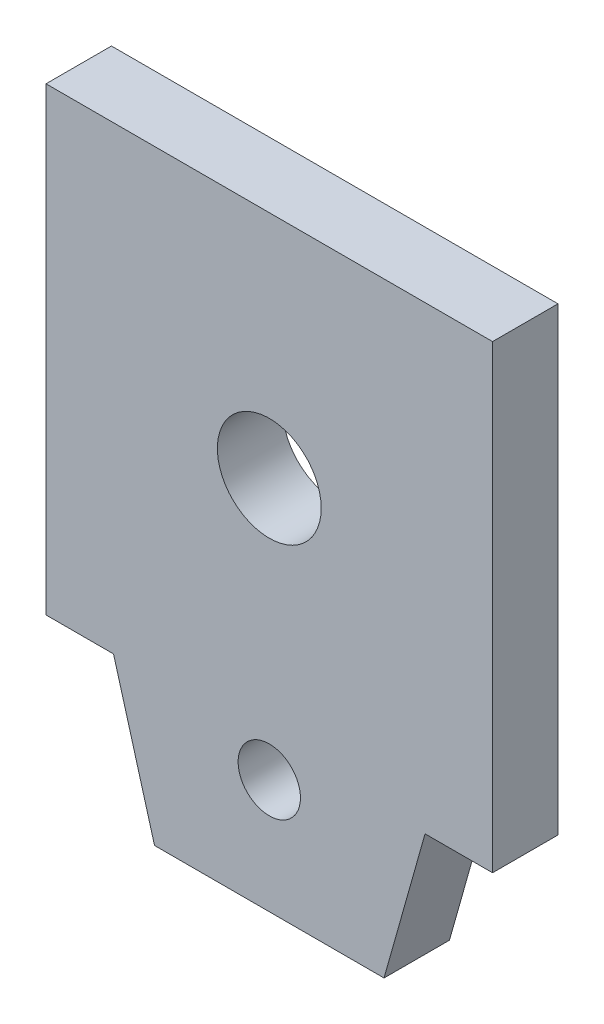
from build123d import *

# Parameters (mm, degrees)
ESQUISSE1_R        = 2.5
ESQUISSE1_R_2      = 1.5
BOSS_EXTRU_1_DEPTH = 3.15


with BuildPart() as part:
    # Esquisse1 → Boss.-Extru.1 (new body)
    with BuildSketch(Plane.XY):
        Polygon((3.25, 0), (5.225, -7), (16.275, -7), (18.25, 0), (21.5, 0), (21.5, 22.15), (0, 22.15), (0, 0), align=None)
        with Locations((10.75, 11.075)):
            Circle(ESQUISSE1_R, mode=Mode.SUBTRACT)
        with Locations((10.75, -1.5)):
            Circle(ESQUISSE1_R_2, mode=Mode.SUBTRACT)
    extrude(amount=BOSS_EXTRU_1_DEPTH)


solid = part.part
